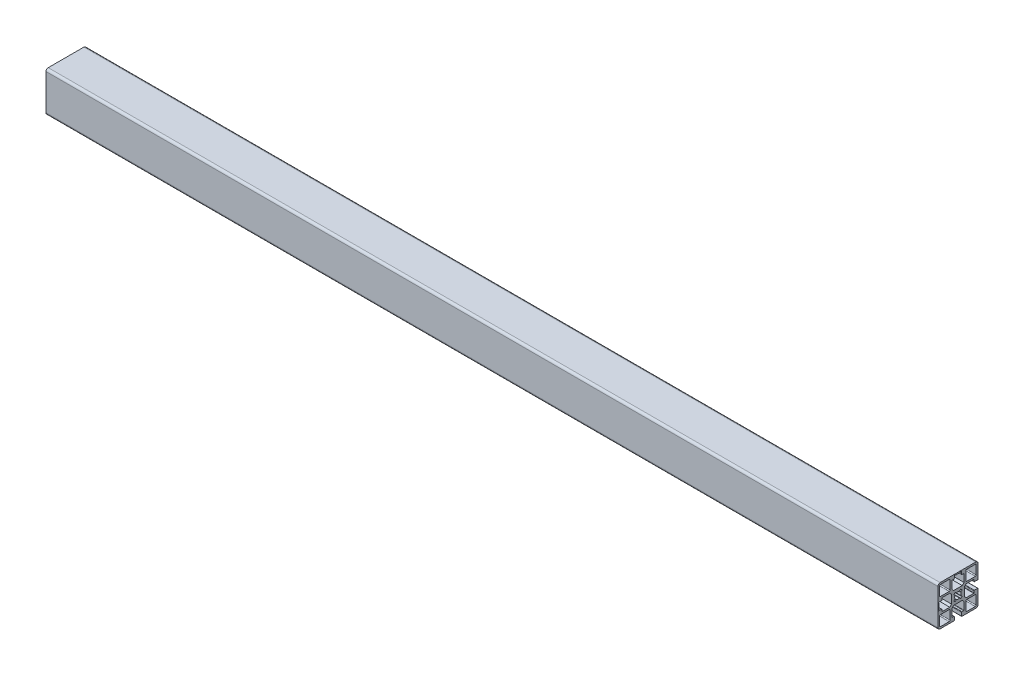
from build123d import *

# Parameters (mm, degrees)
F_45_SARJA_1_0106_45X45_L_2SS_1_DEPTH = 1000


with BuildPart() as part:
    # Model5 → 45-sarja 1.0106 45X45 L 2SS_1 (new body)
    with BuildSketch(Plane(origin=(0, 0, 0), x_dir=(0, 0, -1), z_dir=(1, 0, 0))):
        with BuildLine():
            Line((-4.6, -18), (-6.5, -18))
            ThreePointArc((-6.5, -18), (-6.712132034, -17.912132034), (-6.8, -17.7))
            Line((-6.8, -17.7), (-6.8, -9.2))
            Line((-6.8, -9.2), (-4.8, -7.2))
            Line((-4.8, -7.2), (4.8, -7.2))
            Line((4.8, -7.2), (6.8, -9.2))
            Line((6.8, -9.2), (6.8, -17.7))
            ThreePointArc((6.8, -17.7), (6.712132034, -17.912132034), (6.5, -18))
            Line((6.5, -18), (4.6, -18))
            ThreePointArc((4.6, -18), (4.246446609, -18.146446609), (4.1, -18.5))
            Line((4.1, -18.5), (4.1, -22.2))
            ThreePointArc((4.1, -22.2), (4.187867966, -22.412132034), (4.4, -22.5))
            Line((4.4, -22.5), (20, -22.5))
            ThreePointArc((20, -22.5), (21.767766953, -21.767766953), (22.5, -20))
            Line((22.5, -20), (22.5, -4.4))
            ThreePointArc((22.5, -4.4), (22.412132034, -4.187867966), (22.2, -4.1))
            Line((22.2, -4.1), (18.5, -4.1))
            ThreePointArc((18.5, -4.1), (18.146446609, -4.246446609), (18, -4.6))
            Line((18, -4.6), (18, -6.5))
            ThreePointArc((18, -6.5), (17.912132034, -6.712132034), (17.7, -6.8))
            Line((17.7, -6.8), (9.2, -6.8))
            Line((9.2, -6.8), (7.2, -4.8))
            Line((7.2, -4.8), (7.2, 4.8))
            Line((7.2, 4.8), (9.2, 6.8))
            Line((9.2, 6.8), (17.7, 6.8))
            ThreePointArc((17.7, 6.8), (17.912132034, 6.712132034), (18, 6.5))
            Line((18, 6.5), (18, 4.6))
            ThreePointArc((18, 4.6), (18.146446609, 4.246446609), (18.5, 4.1))
            Line((18.5, 4.1), (22.2, 4.1))
            ThreePointArc((22.2, 4.1), (22.412132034, 4.187867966), (22.5, 4.4))
            Line((22.5, 4.4), (22.5, 20))
            ThreePointArc((22.5, 20), (21.767766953, 21.767766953), (20, 22.5))
            Line((20, 22.5), (-20, 22.5))
            ThreePointArc((-20, 22.5), (-21.767766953, 21.767766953), (-22.5, 20))
            Line((-22.5, 20), (-22.5, -20))
            ThreePointArc((-22.5, -20), (-21.767766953, -21.767766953), (-20, -22.5))
            Line((-20, -22.5), (-4.4, -22.5))
            ThreePointArc((-4.4, -22.5), (-4.187867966, -22.412132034), (-4.1, -22.2))
            Line((-4.1, -22.2), (-4.1, -18.5))
            ThreePointArc((-4.1, -18.5), (-4.246446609, -18.146446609), (-4.6, -18))
        make_face()
        with BuildLine():
            Line((6.5, 18), (4.6, 18))
            ThreePointArc((4.6, 18), (4.246446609, 18.146446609), (4.1, 18.5))
            Line((4.1, 18.5), (4.1, 22.2))
            Line((4.1, 22.2), (3.8, 22.2))
            ThreePointArc((3.8, 22.2), (2.937697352, 21.32205869), (1.75, 21))
            Line((1.75, 21), (-1.75, 21))
            ThreePointArc((-1.75, 21), (-2.937697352, 21.32205869), (-3.8, 22.2))
            Line((-3.8, 22.2), (-4.1, 22.2))
            Line((-4.1, 22.2), (-4.1, 18.5))
            ThreePointArc((-4.1, 18.5), (-4.246446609, 18.146446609), (-4.6, 18))
            Line((-4.6, 18), (-6.5, 18))
            ThreePointArc((-6.5, 18), (-6.712132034, 17.912132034), (-6.8, 17.7))
            Line((-6.8, 17.7), (-6.8, 9.2))
            Line((-6.8, 9.2), (-4.8, 7.2))
            Line((-4.8, 7.2), (4.8, 7.2))
            Line((4.8, 7.2), (6.8, 9.2))
            Line((6.8, 9.2), (6.8, 17.7))
            ThreePointArc((6.8, 17.7), (6.712132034, 17.912132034), (6.5, 18))
        make_face(mode=Mode.SUBTRACT)
        with BuildLine():
            Line((20.5, 9.8), (20.5, 19.5))
            ThreePointArc((20.5, 19.5), (20.207106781, 20.207106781), (19.5, 20.5))
            Line((19.5, 20.5), (9.8, 20.5))
            ThreePointArc((9.8, 20.5), (9.092893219, 20.207106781), (8.8, 19.5))
            Line((8.8, 19.5), (8.8, 9.8))
            ThreePointArc((8.8, 9.8), (9.092893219, 9.092893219), (9.8, 8.8))
            Line((9.8, 8.8), (19.5, 8.8))
            ThreePointArc((19.5, 8.8), (20.207106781, 9.092893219), (20.5, 9.8))
        make_face(mode=Mode.SUBTRACT)
        with BuildLine():
            Line((-9.8, 20.5), (-19.5, 20.5))
            ThreePointArc((-19.5, 20.5), (-20.207106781, 20.207106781), (-20.5, 19.5))
            Line((-20.5, 19.5), (-20.5, 9.8))
            ThreePointArc((-20.5, 9.8), (-20.207106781, 9.092893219), (-19.5, 8.8))
            Line((-19.5, 8.8), (-9.8, 8.8))
            ThreePointArc((-9.8, 8.8), (-9.092893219, 9.092893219), (-8.8, 9.8))
            Line((-8.8, 9.8), (-8.8, 19.5))
            ThreePointArc((-8.8, 19.5), (-9.092893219, 20.207106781), (-9.8, 20.5))
        make_face(mode=Mode.SUBTRACT)
        with BuildLine():
            Line((3.363290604, 1.949077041), (4.384062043, 2.969848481))
            ThreePointArc((4.384062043, 2.969848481), (4.471930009, 3.181980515), (4.384062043, 3.39411255))
            Line((4.384062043, 3.39411255), (3.39411255, 4.384062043))
            ThreePointArc((3.39411255, 4.384062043), (3.181980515, 4.471930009), (2.969848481, 4.384062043))
            Line((2.969848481, 4.384062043), (1.949077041, 3.363290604))
            ThreePointArc((1.949077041, 3.363290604), (1.786690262, 3.279575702), (1.605854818, 3.30557942))
            ThreePointArc((1.605854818, 3.30557942), (0, 3.675), (-1.605854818, 3.30557942))
            ThreePointArc((-1.605854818, 3.30557942), (-1.786690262, 3.279575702), (-1.949077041, 3.363290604))
            Line((-1.949077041, 3.363290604), (-2.969848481, 4.384062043))
            ThreePointArc((-2.969848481, 4.384062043), (-3.181980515, 4.471930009), (-3.39411255, 4.384062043))
            Line((-3.39411255, 4.384062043), (-4.384062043, 3.39411255))
            ThreePointArc((-4.384062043, 3.39411255), (-4.471930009, 3.181980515), (-4.384062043, 2.969848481))
            Line((-4.384062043, 2.969848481), (-3.363290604, 1.949077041))
            ThreePointArc((-3.363290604, 1.949077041), (-3.279575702, 1.786690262), (-3.30557942, 1.605854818))
            ThreePointArc((-3.30557942, 1.605854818), (-3.675, 0), (-3.30557942, -1.605854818))
            ThreePointArc((-3.30557942, -1.605854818), (-3.279575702, -1.786690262), (-3.363290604, -1.949077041))
            Line((-3.363290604, -1.949077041), (-4.384062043, -2.969848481))
            ThreePointArc((-4.384062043, -2.969848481), (-4.471930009, -3.181980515), (-4.384062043, -3.39411255))
            Line((-4.384062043, -3.39411255), (-3.39411255, -4.384062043))
            ThreePointArc((-3.39411255, -4.384062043), (-3.181980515, -4.471930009), (-2.969848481, -4.384062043))
            Line((-2.969848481, -4.384062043), (-1.949077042, -3.363290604))
            ThreePointArc((-1.949077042, -3.363290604), (-1.786690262, -3.279575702), (-1.605854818, -3.30557942))
            ThreePointArc((-1.605854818, -3.30557942), (0, -3.675), (1.605854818, -3.30557942))
            ThreePointArc((1.605854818, -3.30557942), (1.786690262, -3.279575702), (1.949077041, -3.363290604))
            Line((1.949077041, -3.363290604), (2.969848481, -4.384062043))
            ThreePointArc((2.969848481, -4.384062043), (3.181980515, -4.471930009), (3.39411255, -4.384062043))
            Line((3.39411255, -4.384062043), (4.384062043, -3.39411255))
            ThreePointArc((4.384062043, -3.39411255), (4.471930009, -3.181980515), (4.384062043, -2.969848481))
            Line((4.384062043, -2.969848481), (3.363290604, -1.949077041))
            ThreePointArc((3.363290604, -1.949077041), (3.279575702, -1.786690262), (3.30557942, -1.605854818))
            ThreePointArc((3.30557942, -1.605854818), (3.675, 0), (3.30557942, 1.605854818))
            ThreePointArc((3.30557942, 1.605854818), (3.279575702, 1.786690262), (3.363290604, 1.949077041))
        make_face(mode=Mode.SUBTRACT)
        with BuildLine():
            Line((19.5, -8.8), (9.8, -8.8))
            ThreePointArc((9.8, -8.8), (9.092893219, -9.092893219), (8.8, -9.8))
            Line((8.8, -9.8), (8.8, -19.5))
            ThreePointArc((8.8, -19.5), (9.092893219, -20.207106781), (9.8, -20.5))
            Line((9.8, -20.5), (19.5, -20.5))
            ThreePointArc((19.5, -20.5), (20.207106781, -20.207106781), (20.5, -19.5))
            Line((20.5, -19.5), (20.5, -9.8))
            ThreePointArc((20.5, -9.8), (20.207106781, -9.092893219), (19.5, -8.8))
        make_face(mode=Mode.SUBTRACT)
        with BuildLine():
            Line((-19.5, -20.5), (-9.8, -20.5))
            ThreePointArc((-9.8, -20.5), (-9.092893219, -20.207106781), (-8.8, -19.5))
            Line((-8.8, -19.5), (-8.8, -9.8))
            ThreePointArc((-8.8, -9.8), (-9.092893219, -9.092893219), (-9.8, -8.8))
            Line((-9.8, -8.8), (-19.5, -8.8))
            ThreePointArc((-19.5, -8.8), (-20.207106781, -9.092893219), (-20.5, -9.8))
            Line((-20.5, -9.8), (-20.5, -19.5))
            ThreePointArc((-20.5, -19.5), (-20.207106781, -20.207106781), (-19.5, -20.5))
        make_face(mode=Mode.SUBTRACT)
        with BuildLine():
            Line((-18.5, -4.1), (-22.2, -4.1))
            Line((-22.2, -4.1), (-22.2, -3.799390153))
            ThreePointArc((-22.2, -3.799390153), (-21.322070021, -2.937434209), (-21, -1.75))
            Line((-21, -1.75), (-21, 1.75))
            ThreePointArc((-21, 1.75), (-21.322070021, 2.937434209), (-22.2, 3.799390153))
            Line((-22.2, 3.799390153), (-22.2, 4.1))
            Line((-22.2, 4.1), (-18.5, 4.1))
            ThreePointArc((-18.5, 4.1), (-18.146446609, 4.246446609), (-18, 4.6))
            Line((-18, 4.6), (-18, 6.5))
            ThreePointArc((-18, 6.5), (-17.912132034, 6.712132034), (-17.7, 6.8))
            Line((-17.7, 6.8), (-9.2, 6.8))
            Line((-9.2, 6.8), (-7.2, 4.8))
            Line((-7.2, 4.8), (-7.2, -4.8))
            Line((-7.2, -4.8), (-9.2, -6.8))
            Line((-9.2, -6.8), (-17.7, -6.8))
            ThreePointArc((-17.7, -6.8), (-17.912132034, -6.712132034), (-18, -6.5))
            Line((-18, -6.5), (-18, -4.6))
            ThreePointArc((-18, -4.6), (-18.146446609, -4.246446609), (-18.5, -4.1))
        make_face(mode=Mode.SUBTRACT)
    extrude(amount=F_45_SARJA_1_0106_45X45_L_2SS_1_DEPTH)


solid = part.part
